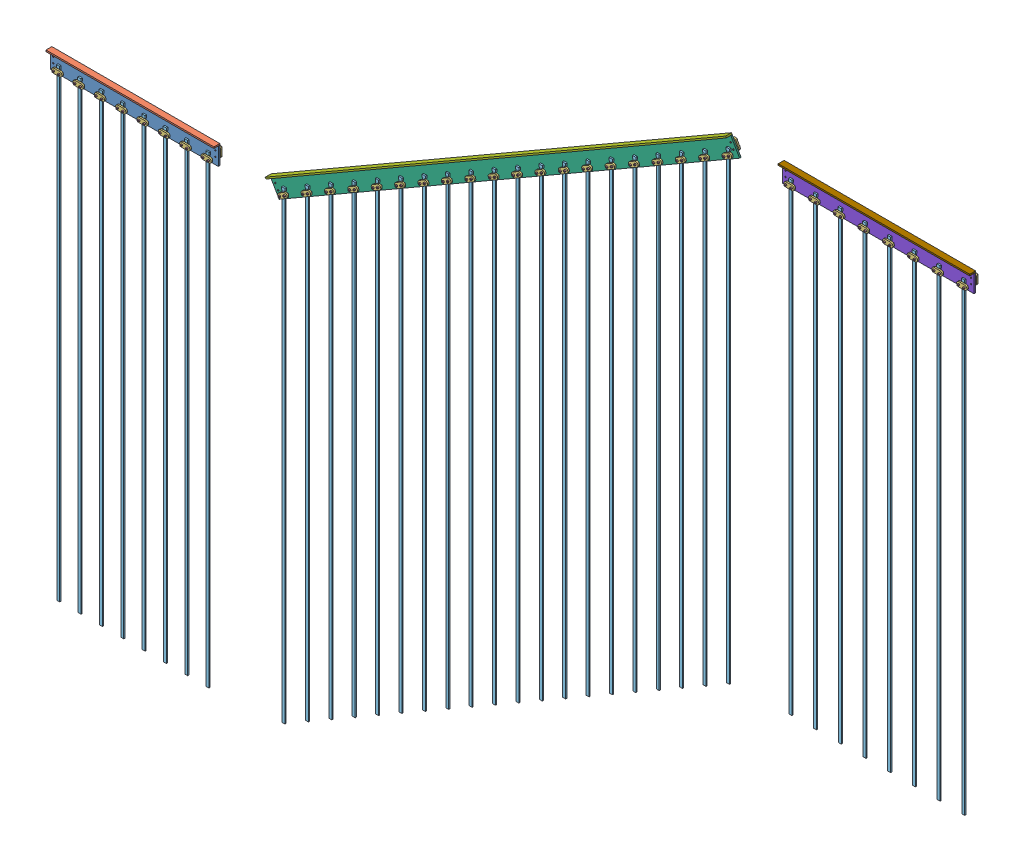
SolidWorks assembly fs-ua-assembly.SLDASM, configuration Default (file format 9000). Lengths in mm.
Overall size (3991.35 3206.92 54.02).
177 component instances, 9 part files, 0 mates.
Components (placement in the parent):
- fs-ua-left-mount-assembly-with-led-strips-1: fs-ua-left-mount-assembly-with-led-strips.SLDASM [Default] at origin size (723.9 2044.33 45.12)
  - fs-ua-left-mount-assembly-with-screws-1: fs-ua-left-mount-assembly-with-screws.SLDASM [Default] at origin size (723.9 82.55 45.12)
    - fs-ua-left-mount-assembly-1: fs-ua-left-mount-assembly.SLDASM [Default] at origin size (723.9 82.55 38.15)
      - fs-ua-left-mount-vertical-component-1: fs-ua-left-mount-vertical-component.SLDPRT [Default] at origin size (723.9 76.2 6.35)
      - fs-ua-left-mount-horizontal-component-1: fs-ua-left-mount-horizontal-component.SLDPRT [Default] at (361.95 76.2 12.7) size (723.9 6.35 25.4)
      - fs-clamp-1: fs-clamp.SLDPRT [Default] at (27.94 15.24 12.7326) size (44.45 20.32 6.35)
      - fs-clamp-2: fs-clamp.SLDPRT [Default] at (12.7 29.845 -12.7409) x (0 1 0) z (0 0 1) size (44.45 20.32 6.35)
      - fs-clamp-3: fs-clamp.SLDPRT [Default] at (711.2 29.845 -6.3972) x (0 1 0) z (0 0 -1) size (44.45 20.32 6.35)
      - fs-clamp-4: fs-clamp.SLDPRT [Default] at (119.9243 15.24 12.7326) size (44.45 20.32 6.35)
      - fs-clamp-5: fs-clamp.SLDPRT [Default] at (211.9086 15.24 12.7326) size (44.45 20.32 6.35)
      - fs-clamp-6: fs-clamp.SLDPRT [Default] at (303.893 15.24 12.7326) size (44.45 20.32 6.35)
      - fs-clamp-7: fs-clamp.SLDPRT [Default] at (395.8773 15.24 12.7326) size (44.45 20.32 6.35)
      - fs-clamp-8: fs-clamp.SLDPRT [Default] at (487.8616 15.24 12.7326) size (44.45 20.32 6.35)
      - fs-clamp-9: fs-clamp.SLDPRT [Default] at (579.8459 15.24 12.7326) size (44.45 20.32 6.35)
      - fs-clamp-10: fs-clamp.SLDPRT [Default] at (671.8303 15.24 12.7326) size (44.45 20.32 6.35)
    - socket head cap screw_ai-1: socket head cap screw_ai.sldprt [HX-SHCS 0.19-32x0.875x0.875-N] at (27.94 15.24 25.0524) x (0 0 -1) z (-0.570283 0.821448 0) size (27.05 7.94 7.94)
    - socket head cap screw_ai-2: socket head cap screw_ai.sldprt [HX-SHCS 0.19-32x0.875x0.875-N] at (711.2 53.975 -19.4006) x (0 0 1) z (-0.954871 -0.29702 0) size (27.05 7.94 7.94)
    - socket head cap screw_ai-3: socket head cap screw_ai.sldprt [HX-SHCS 0.19-32x0.875x0.875-N] at (711.2 29.845 -19.7235) x (0 0 1) z (-0.178736 -0.983897 0) size (27.05 7.94 7.94)
    - socket head cap screw_ai-4: socket head cap screw_ai.sldprt [HX-SHCS 0.19-32x0.875x0.875-N] at (12.7 53.975 -19.387) x (0 0 1) z (0.231262 0.972891 0) size (27.05 7.94 7.94)
    - socket head cap screw_ai-5: socket head cap screw_ai.sldprt [HX-SHCS 0.19-32x0.875x0.875-N] at (12.7 29.845 -19.6757) x (0 0 1) z (-0.841681 -0.539975 0) size (27.05 7.94 7.94)
    - socket head cap screw_ai-6: socket head cap screw_ai.sldprt [HX-SHCS 0.19-32x0.875x0.875-N] at (52.07 15.24 25.3347) x (0 0 -1) z (0.61191 -0.790927 0) size (27.05 7.94 7.94)
    - socket head cap screw_ai-7: socket head cap screw_ai.sldprt [HX-SHCS 0.19-32x0.875x0.875-N] at (119.9251 15.24 25.0524) x (0 0 -1) z (-0.570283 0.821448 0) size (27.05 7.94 7.94)
    - socket head cap screw_ai-8: socket head cap screw_ai.sldprt [HX-SHCS 0.19-32x0.875x0.875-N] at (211.9102 15.24 25.0524) x (0 0 -1) z (-0.570283 0.821448 0) size (27.05 7.94 7.94)
    - socket head cap screw_ai-9: socket head cap screw_ai.sldprt [HX-SHCS 0.19-32x0.875x0.875-N] at (303.8953 15.24 25.0524) x (0 0 -1) z (-0.570283 0.821448 0) size (27.05 7.94 7.94)
    - socket head cap screw_ai-10: socket head cap screw_ai.sldprt [HX-SHCS 0.19-32x0.875x0.875-N] at (395.8803 15.24 25.0524) x (0 0 -1) z (-0.570283 0.821448 0) size (27.05 7.94 7.94)
    - socket head cap screw_ai-11: socket head cap screw_ai.sldprt [HX-SHCS 0.19-32x0.875x0.875-N] at (487.8654 15.24 25.0524) x (0 0 -1) z (-0.570283 0.821448 0) size (27.05 7.94 7.94)
    - socket head cap screw_ai-12: socket head cap screw_ai.sldprt [HX-SHCS 0.19-32x0.875x0.875-N] at (579.8505 15.24 25.0524) x (0 0 -1) z (-0.570283 0.821448 0) size (27.05 7.94 7.94)
    - socket head cap screw_ai-13: socket head cap screw_ai.sldprt [HX-SHCS 0.19-32x0.875x0.875-N] at (671.8356 15.24 25.0524) x (0 0 -1) z (-0.570283 0.821448 0) size (27.05 7.94 7.94)
    - socket head cap screw_ai-14: socket head cap screw_ai.sldprt [HX-SHCS 0.19-32x0.875x0.875-N] at (144.0551 15.24 25.3347) x (0 0 -1) z (0.61191 -0.790927 0) size (27.05 7.94 7.94)
    - socket head cap screw_ai-15: socket head cap screw_ai.sldprt [HX-SHCS 0.19-32x0.875x0.875-N] at (236.0402 15.24 25.3347) x (0 0 -1) z (0.61191 -0.790927 0) size (27.05 7.94 7.94)
    - socket head cap screw_ai-16: socket head cap screw_ai.sldprt [HX-SHCS 0.19-32x0.875x0.875-N] at (328.0253 15.24 25.3347) x (0 0 -1) z (0.61191 -0.790927 0) size (27.05 7.94 7.94)
    - socket head cap screw_ai-17: socket head cap screw_ai.sldprt [HX-SHCS 0.19-32x0.875x0.875-N] at (420.0103 15.24 25.3347) x (0 0 -1) z (0.61191 -0.790927 0) size (27.05 7.94 7.94)
    - socket head cap screw_ai-18: socket head cap screw_ai.sldprt [HX-SHCS 0.19-32x0.875x0.875-N] at (511.9954 15.24 25.3347) x (0 0 -1) z (0.61191 -0.790927 0) size (27.05 7.94 7.94)
    - socket head cap screw_ai-19: socket head cap screw_ai.sldprt [HX-SHCS 0.19-32x0.875x0.875-N] at (603.9805 15.24 25.3347) x (0 0 -1) z (0.61191 -0.790927 0) size (27.05 7.94 7.94)
    - socket head cap screw_ai-20: socket head cap screw_ai.sldprt [HX-SHCS 0.19-32x0.875x0.875-N] at (695.9656 15.24 25.3347) x (0 0 -1) z (0.61191 -0.790927 0) size (27.05 7.94 7.94)
  - fs-led-strip-2: fs-led-strip.SLDPRT [Default] at (39.8281 32.6608 10.0075) size (14.29 2000 6.35)
  - fs-led-strip-3: fs-led-strip.SLDPRT [Default] at (131.8132 32.6608 10.0075) size (14.29 2000 6.35)
  - fs-led-strip-4: fs-led-strip.SLDPRT [Default] at (223.7983 32.6608 10.0075) size (14.29 2000 6.35)
  - fs-led-strip-5: fs-led-strip.SLDPRT [Default] at (315.7834 32.6608 10.0075) size (14.29 2000 6.35)
  - fs-led-strip-6: fs-led-strip.SLDPRT [Default] at (407.7685 32.6608 10.0075) size (14.29 2000 6.35)
  - fs-led-strip-7: fs-led-strip.SLDPRT [Default] at (499.7536 32.6608 10.0075) size (14.29 2000 6.35)
  - fs-led-strip-8: fs-led-strip.SLDPRT [Default] at (591.7386 32.6608 10.0075) size (14.29 2000 6.35)
  - fs-led-strip-9: fs-led-strip.SLDPRT [Default] at (683.7237 32.6608 10.0075) size (14.29 2000 6.35)
- fs-ua-angled-mount-assembly-with-led-strips-1: fs-ua-angled-mount-assembly-with-led-strips.SLDASM [Default] at (1015.3176 66.3158 14.1159) size (2026.51 3158.55 44.16)
  - fs-led-strip-1: fs-led-strip.SLDPRT [Default] at origin size (14.29 2000 6.35)
  - fs-ua-angled-mount-assembly-with-screws-1: fs-ua-angled-mount-assembly-with-screws.SLDASM [Default] at (-24.8458 -53.5614 -9.8077) x (0.866025 0.5 0) z (0 0 1) size (2292.35 82.55 44.16)
    - fs-ua-angled-mount-assembly-1: fs-ua-angled-mount-assembly.SLDASM [Default] at origin size (2292.35 82.55 38)
      - fs-ua-angled-mount-vertical-component-1: fs-ua-angled-mount-vertical-component.SLDPRT [Default] at origin size (2292.35 76.2 6.35)
      - fs-ua-angled-mount-horizontal-component-1: fs-ua-angled-mount-horizontal-component.SLDPRT [Default] at (1146.175 76.2 12.7) size (2292.35 6.35 25.4)
      - fs-clamp-1: fs-clamp.SLDPRT [Default] at (27.94 15.24 12.8007) size (44.45 20.32 6.35)
      - fs-clamp-2: fs-clamp.SLDPRT [Default] at (144.3789 15.24 12.8007) size (44.45 20.32 6.35)
      - fs-clamp-3: fs-clamp.SLDPRT [Default] at (260.8179 15.24 12.8007) size (44.45 20.32 6.35)
      - fs-clamp-4: fs-clamp.SLDPRT [Default] at (377.2568 15.24 12.8007) size (44.45 20.32 6.35)
      - fs-clamp-5: fs-clamp.SLDPRT [Default] at (493.6957 15.24 12.8007) size (44.45 20.32 6.35)
      - fs-clamp-6: fs-clamp.SLDPRT [Default] at (610.1347 15.24 12.8007) size (44.45 20.32 6.35)
      - fs-clamp-7: fs-clamp.SLDPRT [Default] at (726.5736 15.24 12.8007) size (44.45 20.32 6.35)
      - fs-clamp-8: fs-clamp.SLDPRT [Default] at (843.0125 15.24 12.8007) size (44.45 20.32 6.35)
      - fs-clamp-9: fs-clamp.SLDPRT [Default] at (959.4515 15.24 12.8007) size (44.45 20.32 6.35)
      - fs-clamp-10: fs-clamp.SLDPRT [Default] at (1075.8904 15.24 12.8007) size (44.45 20.32 6.35)
      - fs-clamp-11: fs-clamp.SLDPRT [Default] at (1192.3293 15.24 12.8007) size (44.45 20.32 6.35)
      - fs-clamp-12: fs-clamp.SLDPRT [Default] at (1308.7683 15.24 12.8007) size (44.45 20.32 6.35)
      - fs-clamp-13: fs-clamp.SLDPRT [Default] at (1425.2072 15.24 12.8007) size (44.45 20.32 6.35)
      - fs-clamp-14: fs-clamp.SLDPRT [Default] at (1541.6461 15.24 12.8007) size (44.45 20.32 6.35)
      - fs-clamp-15: fs-clamp.SLDPRT [Default] at (1658.0851 15.24 12.8007) size (44.45 20.32 6.35)
      - fs-clamp-16: fs-clamp.SLDPRT [Default] at (1774.524 15.24 12.8007) size (44.45 20.32 6.35)
      - fs-clamp-17: fs-clamp.SLDPRT [Default] at (1890.9629 15.24 12.8007) size (44.45 20.32 6.35)
      - fs-clamp-18: fs-clamp.SLDPRT [Default] at (2007.4019 15.24 12.8007) size (44.45 20.32 6.35)
      - fs-clamp-19: fs-clamp.SLDPRT [Default] at (12.7 53.975 -12.5735) x (0 -1 0) z (0 0 1) size (44.45 20.32 6.35)
      - fs-clamp-20: fs-clamp.SLDPRT [Default] at (2279.65 29.845 -12.5985) x (0 1 0) z (0 0 1) size (44.45 20.32 6.35)
      - fs-clamp-21: fs-clamp.SLDPRT [Default] at (2123.8408 15.24 12.8007) size (44.45 20.32 6.35)
      - fs-clamp-22: fs-clamp.SLDPRT [Default] at (2240.2797 15.24 12.8007) size (44.45 20.32 6.35)
    - socket head cap screw_ai-1: socket head cap screw_ai.sldprt [HX-SHCS 0.19-32x0.875x0.875-N] at (27.94 15.24 25.0524) x (0 0 -1) z (-0.570283 0.821448 0) size (27.05 7.94 7.94)
    - socket head cap screw_ai-3: socket head cap screw_ai.sldprt [HX-SHCS 0.19-32x0.875x0.875-N] at (52.07 15.24 25.3347) x (0 0 -1) z (0.61191 -0.790927 0) size (27.05 7.94 7.94)
    - socket head cap screw_ai-4: socket head cap screw_ai.sldprt [HX-SHCS 0.19-32x0.875x0.875-N] at (12.7 29.845 -18.7638) x (0 0 1) z (-0.601781 -0.798661 0) size (27.05 7.94 7.94)
    - socket head cap screw_ai-5: socket head cap screw_ai.sldprt [HX-SHCS 0.19-32x0.875x0.875-N] at (12.7 53.975 -18.6513) x (0 0 1) z (0.101721 0.994813 0) size (27.05 7.94 7.94)
    - socket head cap screw_ai-6: socket head cap screw_ai.sldprt [HX-SHCS 0.19-32x0.875x0.875-N] at (2279.65 29.845 -18.7537) x (0 0 1) z (-0.220834 -0.975311 0) size (27.05 7.94 7.94)
    - socket head cap screw_ai-7: socket head cap screw_ai.sldprt [HX-SHCS 0.19-32x0.875x0.875-N] at (2279.65 53.975 -18.662) x (0 0 1) z (-0.85708 -0.515183 0) size (27.05 7.94 7.94)
    - socket head cap screw_ai-8: socket head cap screw_ai.sldprt [HX-SHCS 0.19-32x0.875x0.875-N] at (144.3789 15.24 25.0524) x (0 0 -1) z (-0.570283 0.821448 0) size (27.05 7.94 7.94)
    - socket head cap screw_ai-9: socket head cap screw_ai.sldprt [HX-SHCS 0.19-32x0.875x0.875-N] at (260.8179 15.24 25.0524) x (0 0 -1) z (-0.570283 0.821448 0) size (27.05 7.94 7.94)
    - socket head cap screw_ai-10: socket head cap screw_ai.sldprt [HX-SHCS 0.19-32x0.875x0.875-N] at (377.2568 15.24 25.0524) x (0 0 -1) z (-0.570283 0.821448 0) size (27.05 7.94 7.94)
    - socket head cap screw_ai-11: socket head cap screw_ai.sldprt [HX-SHCS 0.19-32x0.875x0.875-N] at (493.6957 15.24 25.0524) x (0 0 -1) z (-0.570283 0.821448 0) size (27.05 7.94 7.94)
    - socket head cap screw_ai-12: socket head cap screw_ai.sldprt [HX-SHCS 0.19-32x0.875x0.875-N] at (610.1347 15.24 25.0524) x (0 0 -1) z (-0.570283 0.821448 0) size (27.05 7.94 7.94)
    - socket head cap screw_ai-13: socket head cap screw_ai.sldprt [HX-SHCS 0.19-32x0.875x0.875-N] at (726.5736 15.24 25.0524) x (0 0 -1) z (-0.570283 0.821448 0) size (27.05 7.94 7.94)
    - socket head cap screw_ai-14: socket head cap screw_ai.sldprt [HX-SHCS 0.19-32x0.875x0.875-N] at (843.0125 15.24 25.0524) x (0 0 -1) z (-0.570283 0.821448 0) size (27.05 7.94 7.94)
    - socket head cap screw_ai-15: socket head cap screw_ai.sldprt [HX-SHCS 0.19-32x0.875x0.875-N] at (959.4515 15.24 25.0524) x (0 0 -1) z (-0.570283 0.821448 0) size (27.05 7.94 7.94)
    - socket head cap screw_ai-16: socket head cap screw_ai.sldprt [HX-SHCS 0.19-32x0.875x0.875-N] at (1075.8904 15.24 25.0524) x (0 0 -1) z (-0.570283 0.821448 0) size (27.05 7.94 7.94)
    - socket head cap screw_ai-17: socket head cap screw_ai.sldprt [HX-SHCS 0.19-32x0.875x0.875-N] at (1192.3293 15.24 25.0524) x (0 0 -1) z (-0.570283 0.821448 0) size (27.05 7.94 7.94)
    - socket head cap screw_ai-18: socket head cap screw_ai.sldprt [HX-SHCS 0.19-32x0.875x0.875-N] at (1308.7683 15.24 25.0524) x (0 0 -1) z (-0.570283 0.821448 0) size (27.05 7.94 7.94)
    - socket head cap screw_ai-19: socket head cap screw_ai.sldprt [HX-SHCS 0.19-32x0.875x0.875-N] at (1425.2072 15.24 25.0524) x (0 0 -1) z (-0.570283 0.821448 0) size (27.05 7.94 7.94)
    - socket head cap screw_ai-20: socket head cap screw_ai.sldprt [HX-SHCS 0.19-32x0.875x0.875-N] at (1541.6461 15.24 25.0524) x (0 0 -1) z (-0.570283 0.821448 0) size (27.05 7.94 7.94)
    - socket head cap screw_ai-21: socket head cap screw_ai.sldprt [HX-SHCS 0.19-32x0.875x0.875-N] at (1658.0851 15.24 25.0524) x (0 0 -1) z (-0.570283 0.821448 0) size (27.05 7.94 7.94)
    - socket head cap screw_ai-22: socket head cap screw_ai.sldprt [HX-SHCS 0.19-32x0.875x0.875-N] at (1774.524 15.24 25.0524) x (0 0 -1) z (-0.570283 0.821448 0) size (27.05 7.94 7.94)
    - socket head cap screw_ai-23: socket head cap screw_ai.sldprt [HX-SHCS 0.19-32x0.875x0.875-N] at (1890.9629 15.24 25.0524) x (0 0 -1) z (-0.570283 0.821448 0) size (27.05 7.94 7.94)
    - socket head cap screw_ai-24: socket head cap screw_ai.sldprt [HX-SHCS 0.19-32x0.875x0.875-N] at (2007.4019 15.24 25.0524) x (0 0 -1) z (-0.570283 0.821448 0) size (27.05 7.94 7.94)
    - socket head cap screw_ai-25: socket head cap screw_ai.sldprt [HX-SHCS 0.19-32x0.875x0.875-N] at (168.4835 15.24 25.3347) x (0 0 -1) z (0.61191 -0.790927 0) size (27.05 7.94 7.94)
    - socket head cap screw_ai-26: socket head cap screw_ai.sldprt [HX-SHCS 0.19-32x0.875x0.875-N] at (284.8971 15.24 25.3347) x (0 0 -1) z (0.61191 -0.790927 0) size (27.05 7.94 7.94)
    - socket head cap screw_ai-27: socket head cap screw_ai.sldprt [HX-SHCS 0.19-32x0.875x0.875-N] at (401.3106 15.24 25.3347) x (0 0 -1) z (0.61191 -0.790927 0) size (27.05 7.94 7.94)
    - socket head cap screw_ai-28: socket head cap screw_ai.sldprt [HX-SHCS 0.19-32x0.875x0.875-N] at (517.7241 15.24 25.3347) x (0 0 -1) z (0.61191 -0.790927 0) size (27.05 7.94 7.94)
    - socket head cap screw_ai-29: socket head cap screw_ai.sldprt [HX-SHCS 0.19-32x0.875x0.875-N] at (634.1377 15.24 25.3347) x (0 0 -1) z (0.61191 -0.790927 0) size (27.05 7.94 7.94)
    - socket head cap screw_ai-30: socket head cap screw_ai.sldprt [HX-SHCS 0.19-32x0.875x0.875-N] at (750.5512 15.24 25.3347) x (0 0 -1) z (0.61191 -0.790927 0) size (27.05 7.94 7.94)
    - socket head cap screw_ai-31: socket head cap screw_ai.sldprt [HX-SHCS 0.19-32x0.875x0.875-N] at (866.9647 15.24 25.3347) x (0 0 -1) z (0.61191 -0.790927 0) size (27.05 7.94 7.94)
    - socket head cap screw_ai-32: socket head cap screw_ai.sldprt [HX-SHCS 0.19-32x0.875x0.875-N] at (983.3783 15.24 25.3347) x (0 0 -1) z (0.61191 -0.790927 0) size (27.05 7.94 7.94)
    - socket head cap screw_ai-33: socket head cap screw_ai.sldprt [HX-SHCS 0.19-32x0.875x0.875-N] at (1099.7918 15.24 25.3347) x (0 0 -1) z (0.61191 -0.790927 0) size (27.05 7.94 7.94)
    - socket head cap screw_ai-34: socket head cap screw_ai.sldprt [HX-SHCS 0.19-32x0.875x0.875-N] at (1216.2053 15.24 25.3347) x (0 0 -1) z (0.61191 -0.790927 0) size (27.05 7.94 7.94)
    - socket head cap screw_ai-35: socket head cap screw_ai.sldprt [HX-SHCS 0.19-32x0.875x0.875-N] at (1332.6189 15.24 25.3347) x (0 0 -1) z (0.61191 -0.790927 0) size (27.05 7.94 7.94)
    - socket head cap screw_ai-36: socket head cap screw_ai.sldprt [HX-SHCS 0.19-32x0.875x0.875-N] at (1449.0324 15.24 25.3347) x (0 0 -1) z (0.61191 -0.790927 0) size (27.05 7.94 7.94)
    - socket head cap screw_ai-37: socket head cap screw_ai.sldprt [HX-SHCS 0.19-32x0.875x0.875-N] at (1565.4459 15.24 25.3347) x (0 0 -1) z (0.61191 -0.790927 0) size (27.05 7.94 7.94)
    - socket head cap screw_ai-38: socket head cap screw_ai.sldprt [HX-SHCS 0.19-32x0.875x0.875-N] at (1681.8595 15.24 25.3347) x (0 0 -1) z (0.61191 -0.790927 0) size (27.05 7.94 7.94)
    - socket head cap screw_ai-39: socket head cap screw_ai.sldprt [HX-SHCS 0.19-32x0.875x0.875-N] at (1798.273 15.24 25.3347) x (0 0 -1) z (0.61191 -0.790927 0) size (27.05 7.94 7.94)
    - socket head cap screw_ai-40: socket head cap screw_ai.sldprt [HX-SHCS 0.19-32x0.875x0.875-N] at (1914.6865 15.24 25.3347) x (0 0 -1) z (0.61191 -0.790927 0) size (27.05 7.94 7.94)
    - socket head cap screw_ai-41: socket head cap screw_ai.sldprt [HX-SHCS 0.19-32x0.875x0.875-N] at (2031.1001 15.24 25.3347) x (0 0 -1) z (0.61191 -0.790927 0) size (27.05 7.94 7.94)
    - socket head cap screw_ai-42: socket head cap screw_ai.sldprt [HX-SHCS 0.19-32x0.875x0.875-N] at (2123.8408 15.24 25.0524) x (0 0 -1) z (-0.570283 0.821448 0) size (27.05 7.94 7.94)
    - socket head cap screw_ai-43: socket head cap screw_ai.sldprt [HX-SHCS 0.19-32x0.875x0.875-N] at (2240.2797 15.24 25.0524) x (0 0 -1) z (-0.570283 0.821448 0) size (27.05 7.94 7.94)
    - socket head cap screw_ai-44: socket head cap screw_ai.sldprt [HX-SHCS 0.19-32x0.875x0.875-N] at (2147.5136 15.24 25.3347) x (0 0 -1) z (0.61191 -0.790927 0) size (27.05 7.94 7.94)
    - socket head cap screw_ai-45: socket head cap screw_ai.sldprt [HX-SHCS 0.19-32x0.875x0.875-N] at (2263.9271 15.24 25.3347) x (0 0 -1) z (0.61191 -0.790927 0) size (27.05 7.94 7.94)
  - fs-led-strip-2: fs-led-strip.SLDPRT [Default] at (100.8391 58.2195 0) size (14.29 2000 6.35)
  - fs-led-strip-3: fs-led-strip.SLDPRT [Default] at (201.6781 116.4389 0) size (14.29 2000 6.35)
  - fs-led-strip-4: fs-led-strip.SLDPRT [Default] at (302.5172 174.6584 0) size (14.29 2000 6.35)
  - fs-led-strip-5: fs-led-strip.SLDPRT [Default] at (403.3563 232.8779 0) size (14.29 2000 6.35)
  - fs-led-strip-6: fs-led-strip.SLDPRT [Default] at (504.1954 291.0973 0) size (14.29 2000 6.35)
  - fs-led-strip-7: fs-led-strip.SLDPRT [Default] at (605.0344 349.3168 0) size (14.29 2000 6.35)
  - fs-led-strip-8: fs-led-strip.SLDPRT [Default] at (705.8735 407.5363 0) size (14.29 2000 6.35)
  - fs-led-strip-9: fs-led-strip.SLDPRT [Default] at (806.7126 465.7557 0) size (14.29 2000 6.35)
  - fs-led-strip-10: fs-led-strip.SLDPRT [Default] at (907.5517 523.9752 0) size (14.29 2000 6.35)
  - fs-led-strip-11: fs-led-strip.SLDPRT [Default] at (1008.3907 582.1947 0) size (14.29 2000 6.35)
  - fs-led-strip-12: fs-led-strip.SLDPRT [Default] at (1109.2298 640.4141 0) size (14.29 2000 6.35)
  - fs-led-strip-13: fs-led-strip.SLDPRT [Default] at (1210.0689 698.6336 0) size (14.29 2000 6.35)
  - fs-led-strip-14: fs-led-strip.SLDPRT [Default] at (1310.908 756.8531 0) size (14.29 2000 6.35)
  - fs-led-strip-15: fs-led-strip.SLDPRT [Default] at (1411.747 815.0725 0) size (14.29 2000 6.35)
  - fs-led-strip-16: fs-led-strip.SLDPRT [Default] at (1512.5861 873.292 0) size (14.29 2000 6.35)
  - fs-led-strip-17: fs-led-strip.SLDPRT [Default] at (1613.4252 931.5115 0) size (14.29 2000 6.35)
  - fs-led-strip-18: fs-led-strip.SLDPRT [Default] at (1714.2643 989.7309 0) size (14.29 2000 6.35)
  - fs-led-strip-19: fs-led-strip.SLDPRT [Default] at (1815.1033 1047.9504 0) size (14.29 2000 6.35)
  - fs-led-strip-20: fs-led-strip.SLDPRT [Default] at (1915.9424 1106.1699 0) size (14.29 2000 6.35)
- fs-ua-right-mount-assembly-with-led-strips-1: fs-ua-right-mount-assembly-with-led-strips.SLDASM [Default] at (3165.8534 1162.5883 8.8963) size (825.5 2044.33 45.12)
  - fs-ua-right-mount-assembly-with-screws-1: fs-ua-right-mount-assembly-with-screws.SLDASM [Default] at origin size (825.5 82.55 45.12)
    - fs-ua-right-mount-assembly-1: fs-ua-right-mount-assembly.SLDASM [Default] at origin size (825.5 82.55 38.15)
      - fs-ua-right-mount-vertical-component-1: fs-ua-right-mount-vertical-component.SLDPRT [Default] at origin size (825.5 76.2 6.35)
      - fs-ua-right-mount-horizontal-component-1: fs-ua-right-mount-horizontal-component.SLDPRT [Default] at (412.75 76.2 12.7) size (825.5 6.35 25.4)
      - fs-clamp-1: fs-clamp.SLDPRT [Default] at (27.94 15.24 12.7326) size (44.45 20.32 6.35)
      - fs-clamp-11: fs-clamp.SLDPRT [Default] at (12.7 29.845 -12.7409) x (0 1 0) z (0 0 1) size (44.45 20.32 6.35)
      - fs-clamp-12: fs-clamp.SLDPRT [Default] at (812.8 29.845 -6.3972) x (0 1 0) z (0 0 -1) size (44.45 20.32 6.35)
      - fs-clamp-4: fs-clamp.SLDPRT [Default] at (134.366 15.24 12.7326) size (44.45 20.32 6.35)
      - fs-clamp-5: fs-clamp.SLDPRT [Default] at (240.792 15.24 12.7326) size (44.45 20.32 6.35)
      - fs-clamp-6: fs-clamp.SLDPRT [Default] at (347.218 15.24 12.7326) size (44.45 20.32 6.35)
      - fs-clamp-7: fs-clamp.SLDPRT [Default] at (453.644 15.24 12.7326) size (44.45 20.32 6.35)
      - fs-clamp-8: fs-clamp.SLDPRT [Default] at (560.07 15.24 12.7326) size (44.45 20.32 6.35)
      - fs-clamp-9: fs-clamp.SLDPRT [Default] at (666.496 15.24 12.7326) size (44.45 20.32 6.35)
      - fs-clamp-10: fs-clamp.SLDPRT [Default] at (772.922 15.24 12.7326) size (44.45 20.32 6.35)
    - socket head cap screw_ai-1: socket head cap screw_ai.sldprt [HX-SHCS 0.19-32x0.875x0.875-N] at (52.07 15.24 25.3347) x (0 0 -1) z (0.61191 -0.790927 0) size (27.05 7.94 7.94)
    - socket head cap screw_ai-2: socket head cap screw_ai.sldprt [HX-SHCS 0.19-32x0.875x0.875-N] at (12.7 29.845 -19.6757) x (0 0 1) z (-0.841681 -0.539975 0) size (27.05 7.94 7.94)
    - socket head cap screw_ai-3: socket head cap screw_ai.sldprt [HX-SHCS 0.19-32x0.875x0.875-N] at (12.7 53.975 -19.387) x (0 0 1) z (0.231262 0.972891 0) size (27.05 7.94 7.94)
    - socket head cap screw_ai-4: socket head cap screw_ai.sldprt [HX-SHCS 0.19-32x0.875x0.875-N] at (812.8 29.845 -19.7235) x (0 0 1) z (-0.178736 -0.983897 0) size (27.05 7.94 7.94)
    - socket head cap screw_ai-5: socket head cap screw_ai.sldprt [HX-SHCS 0.19-32x0.875x0.875-N] at (812.8 53.975 -19.4006) x (0 0 1) z (-0.954871 -0.29702 0) size (27.05 7.94 7.94)
    - socket head cap screw_ai-6: socket head cap screw_ai.sldprt [HX-SHCS 0.19-32x0.875x0.875-N] at (27.94 15.24 25.0524) x (0 0 -1) z (-0.570283 0.821448 0) size (27.05 7.94 7.94)
    - socket head cap screw_ai-7: socket head cap screw_ai.sldprt [HX-SHCS 0.19-32x0.875x0.875-N] at (134.366 15.24 25.0524) x (0 0 -1) z (-0.570283 0.821448 0) size (27.05 7.94 7.94)
    - socket head cap screw_ai-8: socket head cap screw_ai.sldprt [HX-SHCS 0.19-32x0.875x0.875-N] at (240.792 15.24 25.0524) x (0 0 -1) z (-0.570283 0.821448 0) size (27.05 7.94 7.94)
    - socket head cap screw_ai-9: socket head cap screw_ai.sldprt [HX-SHCS 0.19-32x0.875x0.875-N] at (347.218 15.24 25.0524) x (0 0 -1) z (-0.570283 0.821448 0) size (27.05 7.94 7.94)
    - socket head cap screw_ai-10: socket head cap screw_ai.sldprt [HX-SHCS 0.19-32x0.875x0.875-N] at (453.644 15.24 25.0524) x (0 0 -1) z (-0.570283 0.821448 0) size (27.05 7.94 7.94)
    - socket head cap screw_ai-11: socket head cap screw_ai.sldprt [HX-SHCS 0.19-32x0.875x0.875-N] at (560.07 15.24 25.0524) x (0 0 -1) z (-0.570283 0.821448 0) size (27.05 7.94 7.94)
    - socket head cap screw_ai-12: socket head cap screw_ai.sldprt [HX-SHCS 0.19-32x0.875x0.875-N] at (666.496 15.24 25.0524) x (0 0 -1) z (-0.570283 0.821448 0) size (27.05 7.94 7.94)
    - socket head cap screw_ai-13: socket head cap screw_ai.sldprt [HX-SHCS 0.19-32x0.875x0.875-N] at (772.922 15.24 25.0524) x (0 0 -1) z (-0.570283 0.821448 0) size (27.05 7.94 7.94)
    - socket head cap screw_ai-14: socket head cap screw_ai.sldprt [HX-SHCS 0.19-32x0.875x0.875-N] at (158.496 15.24 25.3347) x (0 0 -1) z (0.61191 -0.790927 0) size (27.05 7.94 7.94)
    - socket head cap screw_ai-15: socket head cap screw_ai.sldprt [HX-SHCS 0.19-32x0.875x0.875-N] at (264.922 15.24 25.3347) x (0 0 -1) z (0.61191 -0.790927 0) size (27.05 7.94 7.94)
    - socket head cap screw_ai-16: socket head cap screw_ai.sldprt [HX-SHCS 0.19-32x0.875x0.875-N] at (371.348 15.24 25.3347) x (0 0 -1) z (0.61191 -0.790927 0) size (27.05 7.94 7.94)
    - socket head cap screw_ai-17: socket head cap screw_ai.sldprt [HX-SHCS 0.19-32x0.875x0.875-N] at (477.774 15.24 25.3347) x (0 0 -1) z (0.61191 -0.790927 0) size (27.05 7.94 7.94)
    - socket head cap screw_ai-18: socket head cap screw_ai.sldprt [HX-SHCS 0.19-32x0.875x0.875-N] at (584.2 15.24 25.3347) x (0 0 -1) z (0.61191 -0.790927 0) size (27.05 7.94 7.94)
    - socket head cap screw_ai-19: socket head cap screw_ai.sldprt [HX-SHCS 0.19-32x0.875x0.875-N] at (690.626 15.24 25.3347) x (0 0 -1) z (0.61191 -0.790927 0) size (27.05 7.94 7.94)
    - socket head cap screw_ai-20: socket head cap screw_ai.sldprt [HX-SHCS 0.19-32x0.875x0.875-N] at (797.052 15.24 25.3347) x (0 0 -1) z (0.61191 -0.790927 0) size (27.05 7.94 7.94)
  - fs-led-strip-1: fs-led-strip.SLDPRT [Default] at (39.8281 32.6608 10.0075) size (14.29 2000 6.35)
  - fs-led-strip-2: fs-led-strip.SLDPRT [Default] at (146.2541 32.6608 10.0075) size (14.29 2000 6.35)
  - fs-led-strip-3: fs-led-strip.SLDPRT [Default] at (252.6801 32.6608 10.0075) size (14.29 2000 6.35)
  - fs-led-strip-4: fs-led-strip.SLDPRT [Default] at (359.1061 32.6608 10.0075) size (14.29 2000 6.35)
  - fs-led-strip-5: fs-led-strip.SLDPRT [Default] at (465.5321 32.6608 10.0075) size (14.29 2000 6.35)
  - fs-led-strip-6: fs-led-strip.SLDPRT [Default] at (571.9581 32.6608 10.0075) size (14.29 2000 6.35)
  - fs-led-strip-7: fs-led-strip.SLDPRT [Default] at (678.3841 32.6608 10.0075) size (14.29 2000 6.35)
  - fs-led-strip-8: fs-led-strip.SLDPRT [Default] at (784.8101 32.6608 10.0075) size (14.29 2000 6.35)
